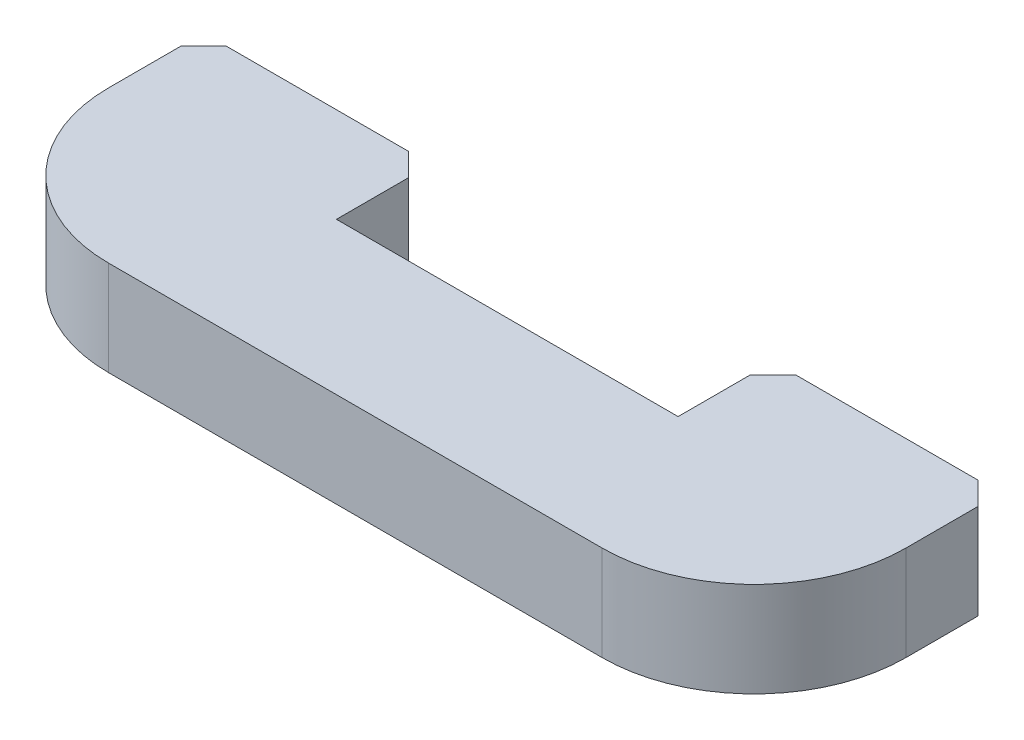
from build123d import *

# Parameters (mm, degrees)
SKETCH1_W           = 26.67
SKETCH1_H           = 8.255
BOSS_EXTRUDE1_DEPTH = 3.175
SKETCH2_W           = 11.43
SKETCH2_H           = 6.35
CUT_EXTRUDE1_DEPTH  = 15.315694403
CHAMFER1_SIZE       = 0.762
FILLET1_R           = 5.08


with BuildPart() as part:
    # Sketch1 → Boss-Extrude1 (new body)
    with BuildSketch(Plane(origin=(0, 0, 0), x_dir=(1, 0, 0), z_dir=(0, 1, 0))):
        Rectangle(SKETCH1_W, SKETCH1_H)
    extrude(amount=BOSS_EXTRUDE1_DEPTH)

    # Sketch2 → Cut-Extrude1 (cut, through all)
    with BuildSketch(Plane(origin=(0, 3.175, 0), x_dir=(1, 0, 0), z_dir=(0, 1, 0))):
        with Locations((0, 4.1275)):
            Rectangle(SKETCH2_W, SKETCH2_H)
    extrude(amount=-CUT_EXTRUDE1_DEPTH, mode=Mode.SUBTRACT)

    # Chamfer1
    chamfer1_edges = [part.edges().sort_by_distance(p)[0] for p in [
        (5.715, 1.5875, -4.1275),
        (-5.715, 1.5875, -4.1275),
        (-13.335, 1.5875, -4.1275),
        (13.335, 1.5875, -4.1275),
    ]]
    chamfer(chamfer1_edges, length=CHAMFER1_SIZE)

    # Fillet1
    fillet1_edges = [part.edges().sort_by_distance(p)[0] for p in [
        (13.335, 1.5875, 4.1275),
        (-13.335, 1.5875, 4.1275),
    ]]
    fillet(fillet1_edges, radius=FILLET1_R)


solid = part.part
